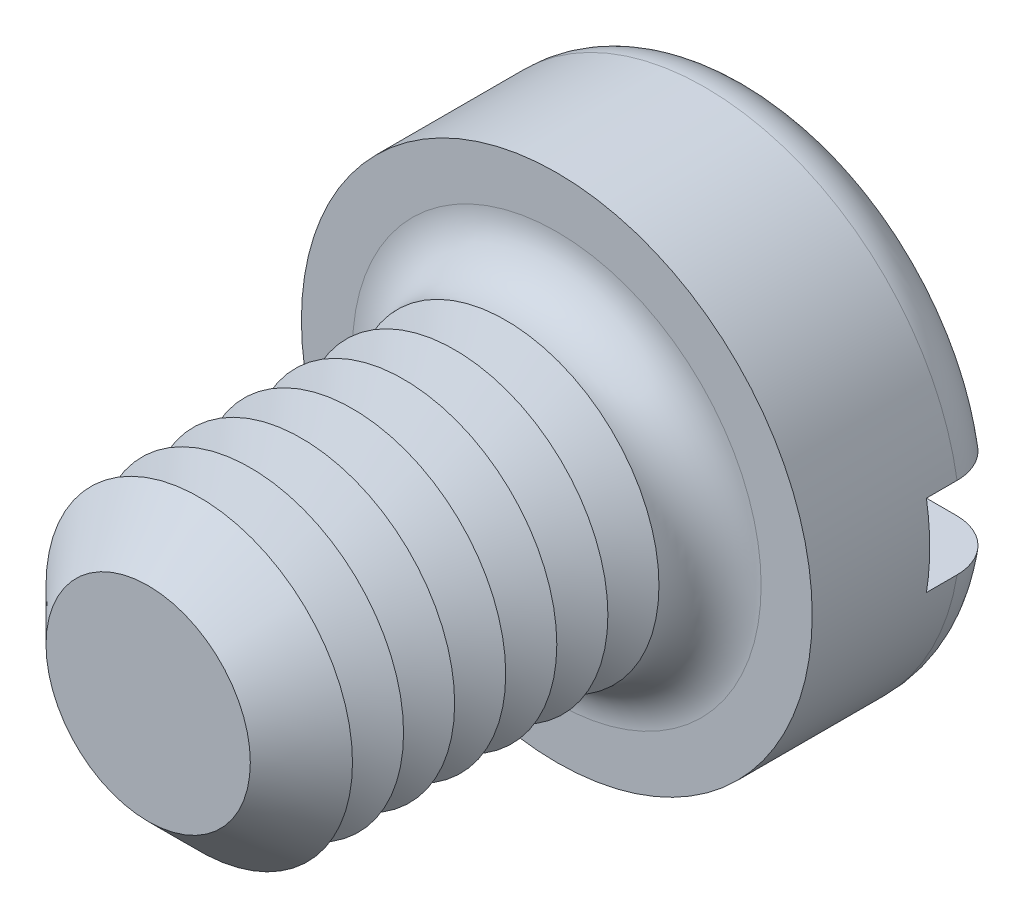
from build123d import *

# Parameters (mm, degrees)
SKETCH3_R           = 5
BOSS_EXTRUDE2_DEPTH = 3.9
SKETCH4_R           = 3
BOSS_EXTRUDE3_DEPTH = 8
FILLET1_R           = 1
CHAMFER1_SIZE       = 1
LPATTERN1_COUNT     = 6
LPATTERN1_PITCH     = 1
SKETCH8_W           = 10
SKETCH8_H           = 1.6
CUT_EXTRUDE1_DEPTH  = 1.6


with BuildPart() as part:
    # Sketch3 → Boss-Extrude2 (new body)
    with BuildSketch(Plane.XY):
        Circle(SKETCH3_R)
    extrude(amount=-BOSS_EXTRUDE2_DEPTH)

    # Sketch4 → Boss-Extrude3 (add)
    with BuildSketch(Plane.XY):
        Circle(SKETCH4_R)
    extrude(amount=BOSS_EXTRUDE3_DEPTH)

    # Fillet1
    fillet1_edges = [part.edges().sort_by_distance(p)[0] for p in [
        (-5, 0, -3.9),
        (-3, 0, 0),
    ]]
    fillet(fillet1_edges, radius=FILLET1_R)

    # Chamfer1
    chamfer1_edges = [part.edges().sort_by_distance(p)[0] for p in [
        (-3, 0, 8),
    ]]
    chamfer(chamfer1_edges, length=CHAMFER1_SIZE)

    # Sketch6 → Cut-Revolve1 (revolve, cut)
    with BuildSketch(Plane(origin=(0, 0, 0), x_dir=(0, 0, -1), z_dir=(1, 0, 0)), mode=Mode.PRIVATE) as cut_revolve1_sk:
        Polygon((-1, 3), (-1.5, 2.133974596), (-2, 3), align=None)
    cut_revolve1 = revolve(cut_revolve1_sk.sketch.rotate(Axis((0, 0, -1.694361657), (0, 0, 1)), 90), axis=Axis((0, 0, -1.694361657), (0, 0, 1)), mode=Mode.SUBTRACT)

    # LPattern1: Cut-Revolve1 ×6
    with Locations(*[(0, 0, i * LPATTERN1_PITCH) for i in range(1, LPATTERN1_COUNT)]):
        add(cut_revolve1, mode=Mode.SUBTRACT)

    # Sketch8 → Cut-Extrude1 (cut)
    with BuildSketch(Plane(origin=(0, 0, -3.9), x_dir=(-1, 0, 0), z_dir=(0, 0, -1))):
        Rectangle(SKETCH8_W, SKETCH8_H)
    extrude(amount=-CUT_EXTRUDE1_DEPTH, mode=Mode.SUBTRACT)


solid = part.part
